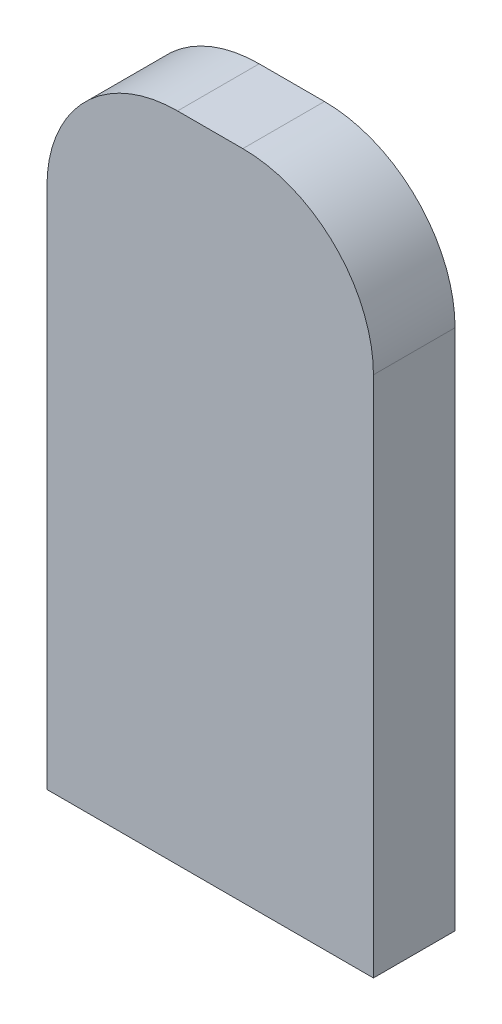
from build123d import *

# Parameters (mm, degrees)
AUFSATZ_LINEAR_AUSTRAGEN1_DEPTH = 5
SKIZZE2_R                       = 5.1
SCHNITT_LINEAR_AUSTRAGEN1_DEPTH = 2.2
VERRUNDUNG1_R                   = 8
SKIZZE2_3_R                     = 5.1
SCHNITT_LINEAR_AUSTRAGEN2_DEPTH = 2.25
SKIZZE2_4_R                     = 5.1
SCHNITT_LINEAR_AUSTRAGEN3_DEPTH = 2.3


with BuildPart() as part:
    # Skizze1 → Aufsatz-Linear austragen1 (new body)
    with BuildSketch(Plane.XY):
        with BuildLine():
            ThreePointArc((15.1, 32.5), (13.606244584, 36.106244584), (10, 37.6))
            Line((10, 37.6), (10, 27.4))
            ThreePointArc((10, 27.4), (13.606244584, 28.893755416), (15.1, 32.5))
        make_face()
        with BuildLine():
            Line((10, 27.4), (10, 37.6))
            ThreePointArc((10, 37.6), (4.9, 32.5), (10, 27.4))
        make_face()
        with BuildLine():
            ThreePointArc((15.1, 32.5), (13.606244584, 36.106244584), (10, 37.6))
            Line((10, 37.6), (10, 27.4))
            ThreePointArc((10, 27.4), (13.606244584, 28.893755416), (15.1, 32.5))
        make_face()
        with BuildLine():
            Line((10, 27.4), (10, 37.6))
            ThreePointArc((10, 37.6), (4.9, 32.5), (10, 27.4))
        make_face()
        with BuildLine():
            ThreePointArc((15.1, 20), (13.606244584, 23.606244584), (10, 25.1))
            Line((10, 25.1), (10, 14.9))
            ThreePointArc((10, 14.9), (13.606244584, 16.393755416), (15.1, 20))
        make_face()
        with BuildLine():
            Line((10, 14.9), (10, 25.1))
            ThreePointArc((10, 25.1), (4.9, 20), (10, 14.9))
        make_face()
        with BuildLine():
            ThreePointArc((15.1, 20), (13.606244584, 23.606244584), (10, 25.1))
            Line((10, 25.1), (10, 14.9))
            ThreePointArc((10, 14.9), (13.606244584, 16.393755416), (15.1, 20))
        make_face()
        with BuildLine():
            Line((10, 14.9), (10, 25.1))
            ThreePointArc((10, 25.1), (4.9, 20), (10, 14.9))
        make_face()
        with BuildLine():
            ThreePointArc((10, 12.6), (4.9, 7.5), (10, 2.4))
            Line((10, 2.4), (10, 12.6))
        make_face()
        with BuildLine():
            Line((10, 12.6), (10, 2.4))
            ThreePointArc((10, 2.4), (13.606244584, 3.893755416), (15.1, 7.5))
            ThreePointArc((15.1, 7.5), (13.606244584, 11.106244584), (10, 12.6))
        make_face()
        with BuildLine():
            ThreePointArc((10, 12.6), (4.9, 7.5), (10, 2.4))
            Line((10, 2.4), (10, 12.6))
        make_face()
        with BuildLine():
            Line((10, 12.6), (10, 2.4))
            ThreePointArc((10, 2.4), (13.606244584, 3.893755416), (15.1, 7.5))
            ThreePointArc((15.1, 7.5), (13.606244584, 11.106244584), (10, 12.6))
        make_face()
        with BuildLine():
            Line((10, 37.6), (10, 40))
            Line((10, 40), (0, 40))
            Line((0, 40), (0, 0))
            Line((0, 0), (10, 0))
            Line((10, 0), (10, 2.4))
            ThreePointArc((10, 2.4), (4.9, 7.5), (10, 12.6))
            Line((10, 12.6), (10, 14.9))
            ThreePointArc((10, 14.9), (4.9, 20), (10, 25.1))
            Line((10, 25.1), (10, 27.4))
            ThreePointArc((10, 27.4), (4.9, 32.5), (10, 37.6))
        make_face()
        with BuildLine():
            Line((20, 40), (10, 40))
            Line((10, 40), (10, 37.6))
            ThreePointArc((10, 37.6), (13.606244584, 36.106244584), (15.1, 32.5))
            ThreePointArc((15.1, 32.5), (13.606244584, 28.893755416), (10, 27.4))
            Line((10, 27.4), (10, 25.1))
            ThreePointArc((10, 25.1), (13.606244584, 23.606244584), (15.1, 20))
            ThreePointArc((15.1, 20), (13.606244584, 16.393755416), (10, 14.9))
            Line((10, 14.9), (10, 12.6))
            ThreePointArc((10, 12.6), (13.606244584, 11.106244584), (15.1, 7.5))
            ThreePointArc((15.1, 7.5), (13.606244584, 3.893755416), (10, 2.4))
            Line((10, 2.4), (10, 0))
            Line((10, 0), (20, 0))
            Line((20, 0), (20, 40))
        make_face()
    extrude(amount=AUFSATZ_LINEAR_AUSTRAGEN1_DEPTH)

    # Skizze2 → Schnitt-Linear austragen1 (cut)
    with BuildSketch(Plane(origin=(0, 0, 0), x_dir=(-1, 0, 0), z_dir=(0, 0, -1))):
        with Locations((-10, 32.5)):
            Circle(SKIZZE2_R)
    extrude(amount=-SCHNITT_LINEAR_AUSTRAGEN1_DEPTH, mode=Mode.SUBTRACT)

    # Verrundung1
    verrundung1_edges = [part.edges().sort_by_distance(p)[0] for p in [
        (0, 40, 2.5),
        (20, 40, 2.5),
    ]]
    fillet(verrundung1_edges, radius=VERRUNDUNG1_R)

    # Skizze2_3 → Schnitt-Linear austragen2 (cut)
    with BuildSketch(Plane(origin=(0, 0, 0), x_dir=(-1, 0, 0), z_dir=(0, 0, -1))):
        with Locations((-10, 20)):
            Circle(SKIZZE2_3_R)
    extrude(amount=-SCHNITT_LINEAR_AUSTRAGEN2_DEPTH, mode=Mode.SUBTRACT)

    # Skizze2_4 → Schnitt-Linear austragen3 (cut)
    with BuildSketch(Plane(origin=(0, 0, 0), x_dir=(-1, 0, 0), z_dir=(0, 0, -1))):
        with Locations((-10, 7.5)):
            Circle(SKIZZE2_4_R)
    extrude(amount=-SCHNITT_LINEAR_AUSTRAGEN3_DEPTH, mode=Mode.SUBTRACT)


solid = part.part
